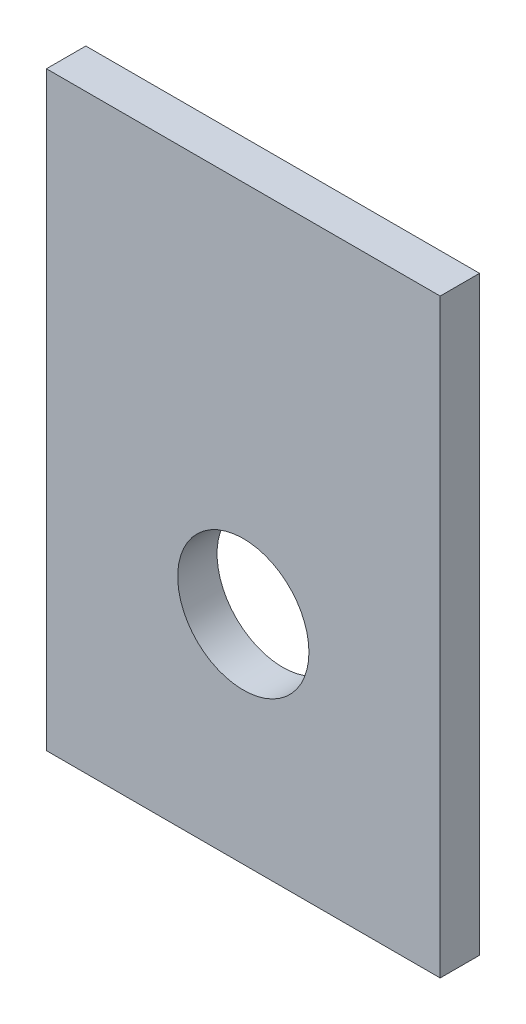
from build123d import *

# Parameters (mm, degrees)
ESQUISSE1_W             = 30
ESQUISSE1_H             = 45
EXTRUSION1_DEPTH        = 3
ESQUISSE2_R             = 5
ENL_V_MAT_EXTRU_1_DEPTH = 3


with BuildPart() as part:
    # Esquisse1 → Extrusion1 (new body)
    with BuildSketch(Plane.XY):
        with Locations((-15, 17.5)):
            Rectangle(ESQUISSE1_W, ESQUISSE1_H)
    extrude(amount=EXTRUSION1_DEPTH)

    # Esquisse2 → Enl_v. mat.-Extru.1 (cut)
    with BuildSketch(Plane.XY.offset(3)):
        with Locations((-15, 11.5)):
            Circle(ESQUISSE2_R)
    extrude(amount=-ENL_V_MAT_EXTRU_1_DEPTH, mode=Mode.SUBTRACT)


solid = part.part
